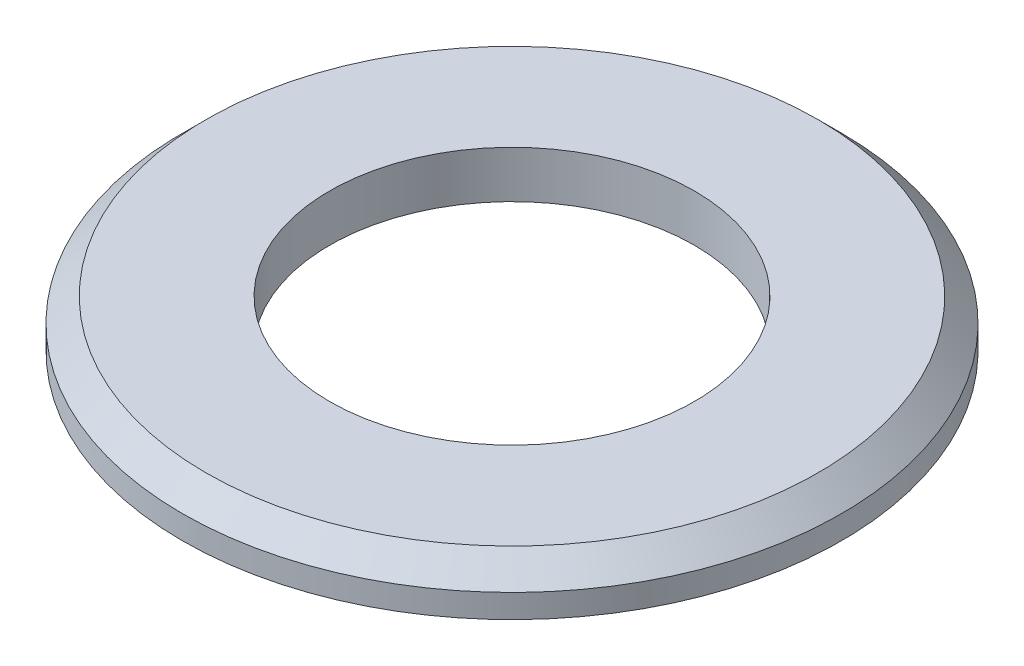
from build123d import *

# Parameters (mm, degrees)
SKETCH1_R      = 28
SKETCH1_R_2    = 15.5
EXTRUDE1_DEPTH = 4
CHAMFER1_SIZE  = 2


with BuildPart() as part:
    # Sketch1 → Extrude1 (new body)
    with BuildSketch(Plane(origin=(0, 0, 0), x_dir=(1, 0, 0), z_dir=(0, 1, 0))):
        with Locations(Location((0, 0, 0), (0, 0, 270))):
            Circle(SKETCH1_R)
        with Locations(Location((0, 0, 0), (0, 0, 270))):
            Circle(SKETCH1_R_2, mode=Mode.SUBTRACT)
    extrude(amount=EXTRUDE1_DEPTH)

    # Chamfer1
    chamfer1_edges = [part.edges().sort_by_distance(p)[0] for p in [
        (0, 4, -28),
    ]]
    chamfer(chamfer1_edges, length=CHAMFER1_SIZE)


solid = part.part
